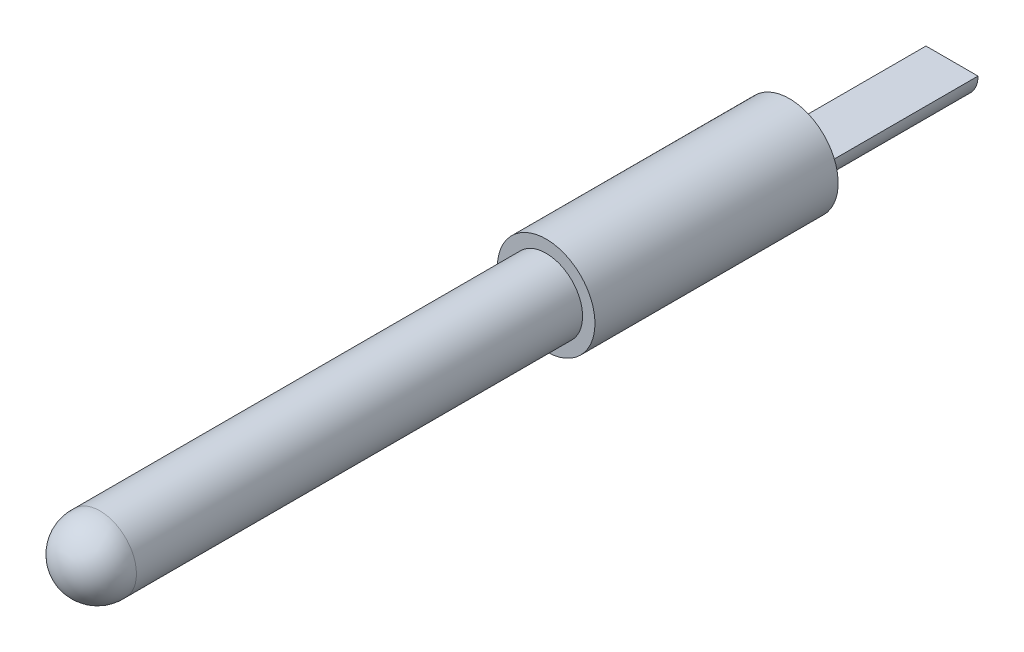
ISO-10303-21;
HEADER;
FILE_DESCRIPTION(('STEP AP214'),'2;1');
FILE_NAME('part.step','',(''),(''),'','','');
FILE_SCHEMA(('AUTOMOTIVE_DESIGN { 1 0 10303 214 1 1 1 1 }'));
ENDSEC;
DATA;
#1=APPLICATION_CONTEXT('core data for automotive mechanical design processes');
#2=APPLICATION_PROTOCOL_DEFINITION('international standard','automotive_design',2000,#1);
#3=PRODUCT_CONTEXT('',#1,'mechanical');
#4=PRODUCT('Part','Part','',(#3));
#5=PRODUCT_RELATED_PRODUCT_CATEGORY('part','',(#4));
#6=PRODUCT_DEFINITION_FORMATION('','',#4);
#7=PRODUCT_DEFINITION_CONTEXT('part definition',#1,'design');
#8=PRODUCT_DEFINITION('design','',#6,#7);
#9=PRODUCT_DEFINITION_SHAPE('','',#8);
#10=(LENGTH_UNIT() NAMED_UNIT(*) SI_UNIT(.MILLI.,.METRE.));
#11=(NAMED_UNIT(*) PLANE_ANGLE_UNIT() SI_UNIT($,.RADIAN.));
#12=(NAMED_UNIT(*) SI_UNIT($,.STERADIAN.) SOLID_ANGLE_UNIT());
#13=UNCERTAINTY_MEASURE_WITH_UNIT(LENGTH_MEASURE(1.E-05),#10,'distance_accuracy_value','');
#14=(GEOMETRIC_REPRESENTATION_CONTEXT(3) GLOBAL_UNCERTAINTY_ASSIGNED_CONTEXT((#13)) GLOBAL_UNIT_ASSIGNED_CONTEXT((#10,
#11,#12)) REPRESENTATION_CONTEXT('',''));
#15=CARTESIAN_POINT('',(0.,0.,0.));
#16=DIRECTION('',(0.,0.,1.));
#17=DIRECTION('',(1.,0.,0.));
#18=AXIS2_PLACEMENT_3D('',#15,#16,#17);
#19=CARTESIAN_POINT('',(0.,0.,8.7122));
#20=DIRECTION('',(0.,0.,-1.));
#21=DIRECTION('',(-1.,0.,0.));
#22=AXIS2_PLACEMENT_3D('',#19,#20,#21);
#23=CYLINDRICAL_SURFACE('',#22,0.7112);
#24=CARTESIAN_POINT('',(0.,0.,8.7122));
#25=DIRECTION('',(0.,0.,1.));
#26=DIRECTION('',(1.,0.,0.));
#27=AXIS2_PLACEMENT_3D('',#24,#25,#26);
#28=CIRCLE('',#27,0.7112);
#29=CARTESIAN_POINT('',(0.7112,0.,8.7122));
#30=VERTEX_POINT('',#29);
#31=EDGE_CURVE('E83',#30,#30,#28,.T.);
#32=ORIENTED_EDGE('',*,*,#31,.F.);
#33=EDGE_LOOP('',(#32));
#34=FACE_BOUND('',#33,.T.);
#35=CARTESIAN_POINT('',(0.,0.,0.));
#36=DIRECTION('',(0.,0.,-1.));
#37=DIRECTION('',(-1.,0.,0.));
#38=AXIS2_PLACEMENT_3D('',#35,#36,#37);
#39=CIRCLE('',#38,0.7112);
#40=CARTESIAN_POINT('',(-0.7112,0.,0.));
#41=VERTEX_POINT('',#40);
#42=EDGE_CURVE('E79',#41,#41,#39,.T.);
#43=ORIENTED_EDGE('',*,*,#42,.F.);
#44=EDGE_LOOP('',(#43));
#45=FACE_BOUND('',#44,.T.);
#46=ADVANCED_FACE('F33',(#34,#45),#23,.T.);
#47=CARTESIAN_POINT('',(0.,0.,8.76130666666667));
#48=DIRECTION('',(0.,0.,1.));
#49=DIRECTION('',(1.,0.,0.));
#50=AXIS2_PLACEMENT_3D('',#47,#48,#49);
#51=SPHERICAL_SURFACE('',#50,0.712893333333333);
#52=ORIENTED_EDGE('',*,*,#31,.T.);
#53=EDGE_LOOP('',(#52));
#54=FACE_BOUND('',#53,.T.);
#55=ADVANCED_FACE('F35',(#54),#51,.T.);
#56=CARTESIAN_POINT('',(0.,0.,0.));
#57=DIRECTION('',(0.,0.,-1.));
#58=DIRECTION('',(-1.,0.,0.));
#59=AXIS2_PLACEMENT_3D('',#56,#57,#58);
#60=PLANE('',#59);
#61=CARTESIAN_POINT('',(0.,0.,0.));
#62=DIRECTION('',(0.,0.,-1.));
#63=DIRECTION('',(-1.,0.,0.));
#64=AXIS2_PLACEMENT_3D('',#61,#62,#63);
#65=CIRCLE('',#64,0.9525);
#66=CARTESIAN_POINT('',(-0.9525,0.,0.));
#67=VERTEX_POINT('',#66);
#68=EDGE_CURVE('E71',#67,#67,#65,.T.);
#69=ORIENTED_EDGE('',*,*,#68,.F.);
#70=EDGE_LOOP('',(#69));
#71=FACE_BOUND('',#70,.T.);
#72=ORIENTED_EDGE('',*,*,#42,.T.);
#73=EDGE_LOOP('',(#72));
#74=FACE_BOUND('',#73,.T.);
#75=ADVANCED_FACE('F92',(#71,#74),#60,.F.);
#76=CARTESIAN_POINT('',(0.,0.,-4.7498));
#77=DIRECTION('',(0.,0.,1.));
#78=DIRECTION('',(1.,0.,0.));
#79=AXIS2_PLACEMENT_3D('',#76,#77,#78);
#80=CYLINDRICAL_SURFACE('',#79,0.9525);
#81=CARTESIAN_POINT('',(0.,0.,-4.7498));
#82=DIRECTION('',(0.,0.,-1.));
#83=DIRECTION('',(-1.,0.,0.));
#84=AXIS2_PLACEMENT_3D('',#81,#82,#83);
#85=CIRCLE('',#84,0.9525);
#86=CARTESIAN_POINT('',(-0.9525,0.,-4.7498));
#87=VERTEX_POINT('',#86);
#88=EDGE_CURVE('E74',#87,#87,#85,.T.);
#89=ORIENTED_EDGE('',*,*,#88,.F.);
#90=EDGE_LOOP('',(#89));
#91=FACE_BOUND('',#90,.T.);
#92=ORIENTED_EDGE('',*,*,#68,.T.);
#93=EDGE_LOOP('',(#92));
#94=FACE_BOUND('',#93,.T.);
#95=ADVANCED_FACE('F94',(#91,#94),#80,.T.);
#96=CARTESIAN_POINT('',(0.,0.,-4.7498));
#97=DIRECTION('',(0.,0.,-1.));
#98=DIRECTION('',(-1.,0.,0.));
#99=AXIS2_PLACEMENT_3D('',#96,#97,#98);
#100=PLANE('',#99);
#101=CARTESIAN_POINT('',(0.,0.,-4.7498));
#102=DIRECTION('',(0.,0.,-1.));
#103=DIRECTION('',(-1.,0.,0.));
#104=AXIS2_PLACEMENT_3D('',#101,#102,#103);
#105=CIRCLE('',#104,0.508);
#106=CARTESIAN_POINT('',(0.508,0.,-4.7498));
#107=VERTEX_POINT('',#106);
#108=CARTESIAN_POINT('',(-0.508,0.,-4.7498));
#109=VERTEX_POINT('',#108);
#110=EDGE_CURVE('E11',#107,#109,#105,.T.);
#111=ORIENTED_EDGE('',*,*,#110,.F.);
#112=DIRECTION('',(1.,0.,0.));
#113=VECTOR('',#112,1.);
#114=CARTESIAN_POINT('',(0.,0.,-4.7498));
#115=LINE('',#114,#113);
#116=EDGE_CURVE('E41',#109,#107,#115,.T.);
#117=ORIENTED_EDGE('',*,*,#116,.F.);
#118=EDGE_LOOP('',(#111,#117));
#119=FACE_BOUND('',#118,.T.);
#120=ORIENTED_EDGE('',*,*,#88,.T.);
#121=EDGE_LOOP('',(#120));
#122=FACE_BOUND('',#121,.T.);
#123=ADVANCED_FACE('F101',(#119,#122),#100,.T.);
#124=CARTESIAN_POINT('',(0.,0.,0.));
#125=DIRECTION('',(0.,0.,1.));
#126=DIRECTION('',(1.,0.,0.));
#127=AXIS2_PLACEMENT_3D('',#124,#125,#126);
#128=CYLINDRICAL_SURFACE('',#127,0.508);
#129=DIRECTION('',(0.,0.,-1.));
#130=VECTOR('',#129,1.);
#131=CARTESIAN_POINT('',(0.508,0.,0.));
#132=LINE('',#131,#130);
#133=CARTESIAN_POINT('',(0.508,0.,-7.9248));
#134=VERTEX_POINT('',#133);
#135=EDGE_CURVE('E56',#107,#134,#132,.T.);
#136=ORIENTED_EDGE('',*,*,#135,.F.);
#137=ORIENTED_EDGE('',*,*,#110,.T.);
#138=DIRECTION('',(0.,0.,-1.));
#139=VECTOR('',#138,1.);
#140=CARTESIAN_POINT('',(-0.508,0.,0.));
#141=LINE('',#140,#139);
#142=CARTESIAN_POINT('',(-0.508,0.,-7.9248));
#143=VERTEX_POINT('',#142);
#144=EDGE_CURVE('E63',#109,#143,#141,.T.);
#145=ORIENTED_EDGE('',*,*,#144,.T.);
#146=CARTESIAN_POINT('',(0.,0.,-7.9248));
#147=DIRECTION('',(0.,0.,1.));
#148=DIRECTION('',(1.,0.,0.));
#149=AXIS2_PLACEMENT_3D('',#146,#147,#148);
#150=CIRCLE('',#149,0.508);
#151=EDGE_CURVE('E68',#143,#134,#150,.T.);
#152=ORIENTED_EDGE('',*,*,#151,.T.);
#153=EDGE_LOOP('',(#136,#137,#145,#152));
#154=FACE_BOUND('',#153,.T.);
#155=ADVANCED_FACE('F70',(#154),#128,.T.);
#156=CARTESIAN_POINT('',(0.,0.,-7.9248));
#157=DIRECTION('',(0.,0.,1.));
#158=DIRECTION('',(1.,0.,0.));
#159=AXIS2_PLACEMENT_3D('',#156,#157,#158);
#160=PLANE('',#159);
#161=DIRECTION('',(-1.,0.,0.));
#162=VECTOR('',#161,1.);
#163=CARTESIAN_POINT('',(0.,0.,-7.9248));
#164=LINE('',#163,#162);
#165=EDGE_CURVE('E60',#134,#143,#164,.T.);
#166=ORIENTED_EDGE('',*,*,#165,.F.);
#167=ORIENTED_EDGE('',*,*,#151,.F.);
#168=EDGE_LOOP('',(#166,#167));
#169=FACE_BOUND('',#168,.T.);
#170=ADVANCED_FACE('F67',(#169),#160,.F.);
#171=CARTESIAN_POINT('',(-0.508,0.,-7.9248));
#172=DIRECTION('',(0.,1.,0.));
#173=DIRECTION('',(0.,0.,1.));
#174=AXIS2_PLACEMENT_3D('',#171,#172,#173);
#175=PLANE('',#174);
#176=ORIENTED_EDGE('',*,*,#144,.F.);
#177=ORIENTED_EDGE('',*,*,#116,.T.);
#178=ORIENTED_EDGE('',*,*,#135,.T.);
#179=ORIENTED_EDGE('',*,*,#165,.T.);
#180=EDGE_LOOP('',(#176,#177,#178,#179));
#181=FACE_BOUND('',#180,.T.);
#182=ADVANCED_FACE('F59',(#181),#175,.T.);
#183=CLOSED_SHELL('',(#46,#55,#75,#95,#123,#155,#170,#182));
#184=MANIFOLD_SOLID_BREP('B2',#183);
#185=ADVANCED_BREP_SHAPE_REPRESENTATION('',(#18,#184),#14);
#186=SHAPE_DEFINITION_REPRESENTATION(#9,#185);
ENDSEC;
END-ISO-10303-21;
